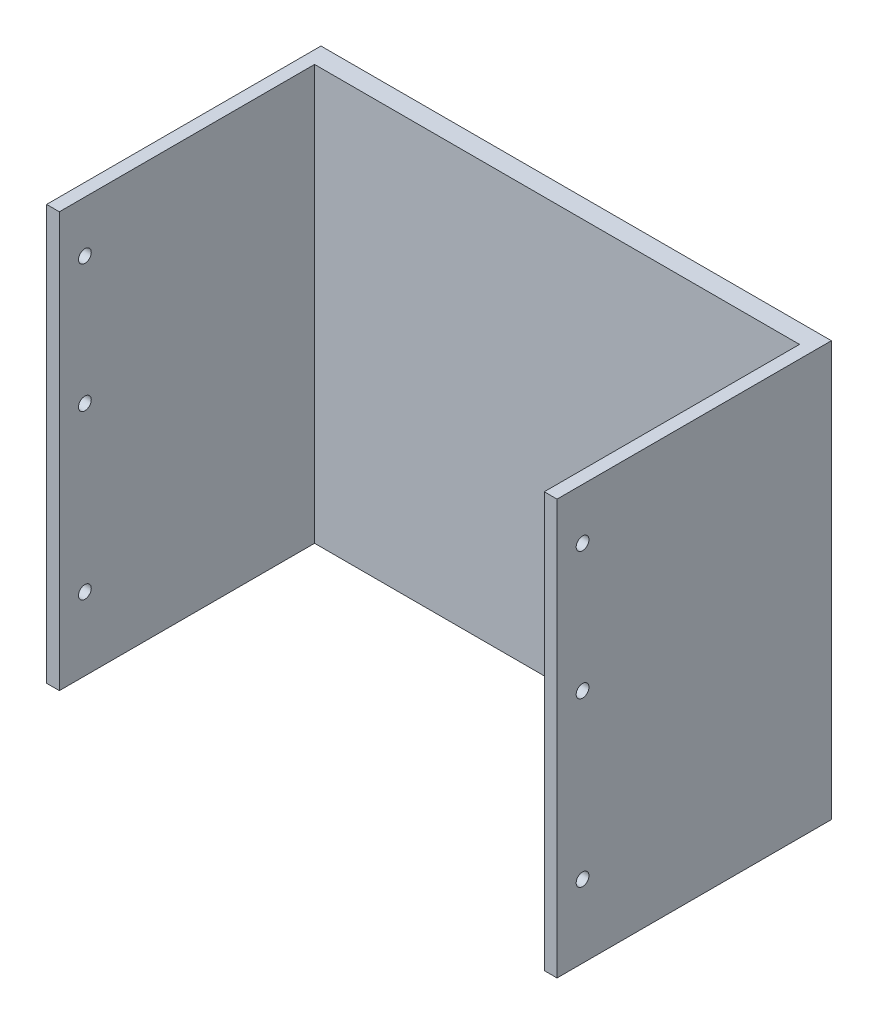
ISO-10303-21;
HEADER;
FILE_DESCRIPTION(('STEP AP214'),'2;1');
FILE_NAME('part.step','',(''),(''),'','','');
FILE_SCHEMA(('AUTOMOTIVE_DESIGN { 1 0 10303 214 1 1 1 1 }'));
ENDSEC;
DATA;
#1=APPLICATION_CONTEXT('core data for automotive mechanical design processes');
#2=APPLICATION_PROTOCOL_DEFINITION('international standard','automotive_design',2000,#1);
#3=PRODUCT_CONTEXT('',#1,'mechanical');
#4=PRODUCT('Part','Part','',(#3));
#5=PRODUCT_RELATED_PRODUCT_CATEGORY('part','',(#4));
#6=PRODUCT_DEFINITION_FORMATION('','',#4);
#7=PRODUCT_DEFINITION_CONTEXT('part definition',#1,'design');
#8=PRODUCT_DEFINITION('design','',#6,#7);
#9=PRODUCT_DEFINITION_SHAPE('','',#8);
#10=(LENGTH_UNIT() NAMED_UNIT(*) SI_UNIT(.MILLI.,.METRE.));
#11=(NAMED_UNIT(*) PLANE_ANGLE_UNIT() SI_UNIT($,.RADIAN.));
#12=(NAMED_UNIT(*) SI_UNIT($,.STERADIAN.) SOLID_ANGLE_UNIT());
#13=UNCERTAINTY_MEASURE_WITH_UNIT(LENGTH_MEASURE(1.E-05),#10,'distance_accuracy_value','');
#14=(GEOMETRIC_REPRESENTATION_CONTEXT(3) GLOBAL_UNCERTAINTY_ASSIGNED_CONTEXT((#13)) GLOBAL_UNIT_ASSIGNED_CONTEXT((#10,
#11,#12)) REPRESENTATION_CONTEXT('',''));
#15=CARTESIAN_POINT('',(0.,0.,0.));
#16=DIRECTION('',(0.,0.,1.));
#17=DIRECTION('',(1.,0.,0.));
#18=AXIS2_PLACEMENT_3D('',#15,#16,#17);
#19=CARTESIAN_POINT('',(40.,32.5,3.));
#20=DIRECTION('',(-1.,0.,0.));
#21=DIRECTION('',(0.,-1.,0.));
#22=AXIS2_PLACEMENT_3D('',#19,#20,#21);
#23=PLANE('',#22);
#24=CARTESIAN_POINT('',(40.,24.5,39.));
#25=DIRECTION('',(-1.,0.,0.));
#26=DIRECTION('',(0.,-1.,0.));
#27=AXIS2_PLACEMENT_3D('',#24,#25,#26);
#28=CIRCLE('',#27,0.999999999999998);
#29=CARTESIAN_POINT('',(40.,23.5,39.));
#30=VERTEX_POINT('',#29);
#31=EDGE_CURVE('E220',#30,#30,#28,.T.);
#32=ORIENTED_EDGE('',*,*,#31,.T.);
#33=EDGE_LOOP('',(#32));
#34=FACE_BOUND('',#33,.T.);
#35=CARTESIAN_POINT('',(40.,-21.0951452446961,39.));
#36=DIRECTION('',(-1.,0.,0.));
#37=DIRECTION('',(0.,-1.,0.));
#38=AXIS2_PLACEMENT_3D('',#35,#36,#37);
#39=CIRCLE('',#38,0.999999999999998);
#40=CARTESIAN_POINT('',(40.,-22.0951452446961,39.));
#41=VERTEX_POINT('',#40);
#42=EDGE_CURVE('E246',#41,#41,#39,.T.);
#43=ORIENTED_EDGE('',*,*,#42,.T.);
#44=EDGE_LOOP('',(#43));
#45=FACE_BOUND('',#44,.T.);
#46=CARTESIAN_POINT('',(40.,4.48535256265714,39.));
#47=DIRECTION('',(-1.,0.,0.));
#48=DIRECTION('',(0.,-1.,0.));
#49=AXIS2_PLACEMENT_3D('',#46,#47,#48);
#50=CIRCLE('',#49,0.999999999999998);
#51=CARTESIAN_POINT('',(40.,3.48535256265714,39.));
#52=VERTEX_POINT('',#51);
#53=EDGE_CURVE('E242',#52,#52,#50,.T.);
#54=ORIENTED_EDGE('',*,*,#53,.T.);
#55=EDGE_LOOP('',(#54));
#56=FACE_BOUND('',#55,.T.);
#57=DIRECTION('',(0.,1.,0.));
#58=VECTOR('',#57,1.);
#59=CARTESIAN_POINT('',(40.,32.5,0.));
#60=LINE('',#59,#58);
#61=CARTESIAN_POINT('',(40.,-32.5,0.));
#62=VERTEX_POINT('',#61);
#63=CARTESIAN_POINT('',(40.,32.5,0.));
#64=VERTEX_POINT('',#63);
#65=EDGE_CURVE('E156',#62,#64,#60,.T.);
#66=ORIENTED_EDGE('',*,*,#65,.T.);
#67=DIRECTION('',(0.,0.,-1.));
#68=VECTOR('',#67,1.);
#69=CARTESIAN_POINT('',(40.,32.5,3.));
#70=LINE('',#69,#68);
#71=CARTESIAN_POINT('',(40.,32.5,43.));
#72=VERTEX_POINT('',#71);
#73=EDGE_CURVE('E11',#72,#64,#70,.T.);
#74=ORIENTED_EDGE('',*,*,#73,.F.);
#75=DIRECTION('',(0.,1.,0.));
#76=VECTOR('',#75,1.);
#77=CARTESIAN_POINT('',(40.,32.5,43.));
#78=LINE('',#77,#76);
#79=CARTESIAN_POINT('',(40.,-32.5,43.));
#80=VERTEX_POINT('',#79);
#81=EDGE_CURVE('E169',#80,#72,#78,.T.);
#82=ORIENTED_EDGE('',*,*,#81,.F.);
#83=DIRECTION('',(0.,0.,-1.));
#84=VECTOR('',#83,1.);
#85=CARTESIAN_POINT('',(40.,-32.5,3.));
#86=LINE('',#85,#84);
#87=EDGE_CURVE('E122',#80,#62,#86,.T.);
#88=ORIENTED_EDGE('',*,*,#87,.T.);
#89=EDGE_LOOP('',(#66,#74,#82,#88));
#90=FACE_BOUND('',#89,.T.);
#91=ADVANCED_FACE('F45',(#34,#45,#56,#90),#23,.F.);
#92=CARTESIAN_POINT('',(-40.,32.5,3.));
#93=DIRECTION('',(0.,-1.,0.));
#94=DIRECTION('',(0.,0.,-1.));
#95=AXIS2_PLACEMENT_3D('',#92,#93,#94);
#96=PLANE('',#95);
#97=DIRECTION('',(-1.,0.,0.));
#98=VECTOR('',#97,1.);
#99=CARTESIAN_POINT('',(-40.,32.5,0.));
#100=LINE('',#99,#98);
#101=CARTESIAN_POINT('',(-40.,32.5,0.));
#102=VERTEX_POINT('',#101);
#103=EDGE_CURVE('E192',#64,#102,#100,.T.);
#104=ORIENTED_EDGE('',*,*,#103,.T.);
#105=DIRECTION('',(0.,0.,-1.));
#106=VECTOR('',#105,1.);
#107=CARTESIAN_POINT('',(-40.,32.5,3.));
#108=LINE('',#107,#106);
#109=CARTESIAN_POINT('',(-40.,32.5,43.));
#110=VERTEX_POINT('',#109);
#111=EDGE_CURVE('E54',#110,#102,#108,.T.);
#112=ORIENTED_EDGE('',*,*,#111,.F.);
#113=DIRECTION('',(-1.,0.,0.));
#114=VECTOR('',#113,1.);
#115=CARTESIAN_POINT('',(-40.,32.5,43.));
#116=LINE('',#115,#114);
#117=CARTESIAN_POINT('',(-38.,32.5,43.));
#118=VERTEX_POINT('',#117);
#119=EDGE_CURVE('E137',#118,#110,#116,.T.);
#120=ORIENTED_EDGE('',*,*,#119,.F.);
#121=DIRECTION('',(0.,0.,-1.));
#122=VECTOR('',#121,1.);
#123=CARTESIAN_POINT('',(-38.,32.5,43.));
#124=LINE('',#123,#122);
#125=CARTESIAN_POINT('',(-38.,32.5,3.));
#126=VERTEX_POINT('',#125);
#127=EDGE_CURVE('E149',#118,#126,#124,.T.);
#128=ORIENTED_EDGE('',*,*,#127,.T.);
#129=DIRECTION('',(-1.,0.,0.));
#130=VECTOR('',#129,1.);
#131=CARTESIAN_POINT('',(-40.,32.5,3.));
#132=LINE('',#131,#130);
#133=CARTESIAN_POINT('',(38.,32.5,3.));
#134=VERTEX_POINT('',#133);
#135=EDGE_CURVE('E182',#134,#126,#132,.T.);
#136=ORIENTED_EDGE('',*,*,#135,.F.);
#137=DIRECTION('',(0.,0.,-1.));
#138=VECTOR('',#137,1.);
#139=CARTESIAN_POINT('',(38.,32.5,43.));
#140=LINE('',#139,#138);
#141=CARTESIAN_POINT('',(38.,32.5,43.));
#142=VERTEX_POINT('',#141);
#143=EDGE_CURVE('E157',#142,#134,#140,.T.);
#144=ORIENTED_EDGE('',*,*,#143,.F.);
#145=DIRECTION('',(-1.,0.,0.));
#146=VECTOR('',#145,1.);
#147=CARTESIAN_POINT('',(40.,32.5,43.));
#148=LINE('',#147,#146);
#149=EDGE_CURVE('E176',#72,#142,#148,.T.);
#150=ORIENTED_EDGE('',*,*,#149,.F.);
#151=ORIENTED_EDGE('',*,*,#73,.T.);
#152=EDGE_LOOP('',(#104,#112,#120,#128,#136,#144,#150,#151));
#153=FACE_BOUND('',#152,.T.);
#154=ADVANCED_FACE('F267',(#153),#96,.F.);
#155=CARTESIAN_POINT('',(-40.,32.5,3.));
#156=DIRECTION('',(1.,0.,0.));
#157=DIRECTION('',(0.,1.,0.));
#158=AXIS2_PLACEMENT_3D('',#155,#156,#157);
#159=PLANE('',#158);
#160=CARTESIAN_POINT('',(-40.,24.5,39.));
#161=DIRECTION('',(-1.,0.,0.));
#162=DIRECTION('',(0.,-1.,0.));
#163=AXIS2_PLACEMENT_3D('',#160,#161,#162);
#164=CIRCLE('',#163,0.999999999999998);
#165=CARTESIAN_POINT('',(-40.,23.5,39.));
#166=VERTEX_POINT('',#165);
#167=EDGE_CURVE('E209',#166,#166,#164,.T.);
#168=ORIENTED_EDGE('',*,*,#167,.F.);
#169=EDGE_LOOP('',(#168));
#170=FACE_BOUND('',#169,.T.);
#171=CARTESIAN_POINT('',(-40.,-21.0951452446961,39.));
#172=DIRECTION('',(-1.,0.,0.));
#173=DIRECTION('',(0.,-1.,0.));
#174=AXIS2_PLACEMENT_3D('',#171,#172,#173);
#175=CIRCLE('',#174,0.999999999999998);
#176=CARTESIAN_POINT('',(-40.,-22.0951452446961,39.));
#177=VERTEX_POINT('',#176);
#178=EDGE_CURVE('E231',#177,#177,#175,.T.);
#179=ORIENTED_EDGE('',*,*,#178,.F.);
#180=EDGE_LOOP('',(#179));
#181=FACE_BOUND('',#180,.T.);
#182=CARTESIAN_POINT('',(-40.,4.48535256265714,39.));
#183=DIRECTION('',(-1.,0.,0.));
#184=DIRECTION('',(0.,-1.,0.));
#185=AXIS2_PLACEMENT_3D('',#182,#183,#184);
#186=CIRCLE('',#185,0.999999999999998);
#187=CARTESIAN_POINT('',(-40.,3.48535256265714,39.));
#188=VERTEX_POINT('',#187);
#189=EDGE_CURVE('E143',#188,#188,#186,.T.);
#190=ORIENTED_EDGE('',*,*,#189,.F.);
#191=EDGE_LOOP('',(#190));
#192=FACE_BOUND('',#191,.T.);
#193=DIRECTION('',(0.,-1.,0.));
#194=VECTOR('',#193,1.);
#195=CARTESIAN_POINT('',(-40.,32.5,0.));
#196=LINE('',#195,#194);
#197=CARTESIAN_POINT('',(-40.,-32.5,0.));
#198=VERTEX_POINT('',#197);
#199=EDGE_CURVE('E118',#102,#198,#196,.T.);
#200=ORIENTED_EDGE('',*,*,#199,.T.);
#201=DIRECTION('',(0.,0.,-1.));
#202=VECTOR('',#201,1.);
#203=CARTESIAN_POINT('',(-40.,-32.5,3.));
#204=LINE('',#203,#202);
#205=CARTESIAN_POINT('',(-40.,-32.5,43.));
#206=VERTEX_POINT('',#205);
#207=EDGE_CURVE('E111',#206,#198,#204,.T.);
#208=ORIENTED_EDGE('',*,*,#207,.F.);
#209=DIRECTION('',(0.,-1.,0.));
#210=VECTOR('',#209,1.);
#211=CARTESIAN_POINT('',(-40.,32.5,43.));
#212=LINE('',#211,#210);
#213=EDGE_CURVE('E116',#110,#206,#212,.T.);
#214=ORIENTED_EDGE('',*,*,#213,.F.);
#215=ORIENTED_EDGE('',*,*,#111,.T.);
#216=EDGE_LOOP('',(#200,#208,#214,#215));
#217=FACE_BOUND('',#216,.T.);
#218=ADVANCED_FACE('F113',(#170,#181,#192,#217),#159,.F.);
#219=CARTESIAN_POINT('',(-40.,-32.5,3.));
#220=DIRECTION('',(0.,1.,0.));
#221=DIRECTION('',(0.,0.,1.));
#222=AXIS2_PLACEMENT_3D('',#219,#220,#221);
#223=PLANE('',#222);
#224=DIRECTION('',(1.,0.,0.));
#225=VECTOR('',#224,1.);
#226=CARTESIAN_POINT('',(-40.,-32.5,0.));
#227=LINE('',#226,#225);
#228=EDGE_CURVE('E186',#198,#62,#227,.T.);
#229=ORIENTED_EDGE('',*,*,#228,.T.);
#230=ORIENTED_EDGE('',*,*,#87,.F.);
#231=DIRECTION('',(1.,0.,0.));
#232=VECTOR('',#231,1.);
#233=CARTESIAN_POINT('',(40.,-32.5,43.));
#234=LINE('',#233,#232);
#235=CARTESIAN_POINT('',(38.,-32.5,43.));
#236=VERTEX_POINT('',#235);
#237=EDGE_CURVE('E166',#236,#80,#234,.T.);
#238=ORIENTED_EDGE('',*,*,#237,.F.);
#239=DIRECTION('',(0.,0.,-1.));
#240=VECTOR('',#239,1.);
#241=CARTESIAN_POINT('',(38.,-32.5,43.));
#242=LINE('',#241,#240);
#243=CARTESIAN_POINT('',(38.,-32.5,3.));
#244=VERTEX_POINT('',#243);
#245=EDGE_CURVE('E161',#236,#244,#242,.T.);
#246=ORIENTED_EDGE('',*,*,#245,.T.);
#247=DIRECTION('',(1.,0.,0.));
#248=VECTOR('',#247,1.);
#249=CARTESIAN_POINT('',(-40.,-32.5,3.));
#250=LINE('',#249,#248);
#251=CARTESIAN_POINT('',(-38.,-32.5,3.));
#252=VERTEX_POINT('',#251);
#253=EDGE_CURVE('E185',#252,#244,#250,.T.);
#254=ORIENTED_EDGE('',*,*,#253,.F.);
#255=DIRECTION('',(0.,0.,-1.));
#256=VECTOR('',#255,1.);
#257=CARTESIAN_POINT('',(-38.,-32.5,43.));
#258=LINE('',#257,#256);
#259=CARTESIAN_POINT('',(-38.,-32.5,43.));
#260=VERTEX_POINT('',#259);
#261=EDGE_CURVE('E128',#260,#252,#258,.T.);
#262=ORIENTED_EDGE('',*,*,#261,.F.);
#263=DIRECTION('',(1.,0.,0.));
#264=VECTOR('',#263,1.);
#265=CARTESIAN_POINT('',(-40.,-32.5,43.));
#266=LINE('',#265,#264);
#267=EDGE_CURVE('E125',#206,#260,#266,.T.);
#268=ORIENTED_EDGE('',*,*,#267,.F.);
#269=ORIENTED_EDGE('',*,*,#207,.T.);
#270=EDGE_LOOP('',(#229,#230,#238,#246,#254,#262,#268,#269));
#271=FACE_BOUND('',#270,.T.);
#272=ADVANCED_FACE('F126',(#271),#223,.F.);
#273=CARTESIAN_POINT('',(0.,0.,3.));
#274=DIRECTION('',(0.,0.,1.));
#275=DIRECTION('',(1.,0.,0.));
#276=AXIS2_PLACEMENT_3D('',#273,#274,#275);
#277=PLANE('',#276);
#278=DIRECTION('',(0.,1.,0.));
#279=VECTOR('',#278,1.);
#280=CARTESIAN_POINT('',(-38.,32.5,3.));
#281=LINE('',#280,#279);
#282=EDGE_CURVE('E62',#252,#126,#281,.T.);
#283=ORIENTED_EDGE('',*,*,#282,.F.);
#284=ORIENTED_EDGE('',*,*,#253,.T.);
#285=DIRECTION('',(0.,-1.,0.));
#286=VECTOR('',#285,1.);
#287=CARTESIAN_POINT('',(38.,32.5,3.));
#288=LINE('',#287,#286);
#289=EDGE_CURVE('E67',#134,#244,#288,.T.);
#290=ORIENTED_EDGE('',*,*,#289,.F.);
#291=ORIENTED_EDGE('',*,*,#135,.T.);
#292=EDGE_LOOP('',(#283,#284,#290,#291));
#293=FACE_BOUND('',#292,.T.);
#294=ADVANCED_FACE('F283',(#293),#277,.T.);
#295=CARTESIAN_POINT('',(0.,0.,0.));
#296=DIRECTION('',(0.,0.,1.));
#297=DIRECTION('',(1.,0.,0.));
#298=AXIS2_PLACEMENT_3D('',#295,#296,#297);
#299=PLANE('',#298);
#300=ORIENTED_EDGE('',*,*,#65,.F.);
#301=ORIENTED_EDGE('',*,*,#228,.F.);
#302=ORIENTED_EDGE('',*,*,#199,.F.);
#303=ORIENTED_EDGE('',*,*,#103,.F.);
#304=EDGE_LOOP('',(#300,#301,#302,#303));
#305=FACE_BOUND('',#304,.T.);
#306=ADVANCED_FACE('F284',(#305),#299,.F.);
#307=CARTESIAN_POINT('',(38.,32.5,43.));
#308=DIRECTION('',(1.,0.,0.));
#309=DIRECTION('',(0.,1.,0.));
#310=AXIS2_PLACEMENT_3D('',#307,#308,#309);
#311=PLANE('',#310);
#312=CARTESIAN_POINT('',(38.,24.5,39.));
#313=DIRECTION('',(1.,0.,0.));
#314=DIRECTION('',(0.,1.,0.));
#315=AXIS2_PLACEMENT_3D('',#312,#313,#314);
#316=CIRCLE('',#315,0.999999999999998);
#317=CARTESIAN_POINT('',(38.,25.5,39.));
#318=VERTEX_POINT('',#317);
#319=EDGE_CURVE('E48',#318,#318,#316,.F.);
#320=ORIENTED_EDGE('',*,*,#319,.F.);
#321=EDGE_LOOP('',(#320));
#322=FACE_BOUND('',#321,.T.);
#323=CARTESIAN_POINT('',(38.,-21.0951452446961,39.));
#324=DIRECTION('',(1.,0.,0.));
#325=DIRECTION('',(0.,1.,0.));
#326=AXIS2_PLACEMENT_3D('',#323,#324,#325);
#327=CIRCLE('',#326,0.999999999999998);
#328=CARTESIAN_POINT('',(38.,-20.0951452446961,39.));
#329=VERTEX_POINT('',#328);
#330=EDGE_CURVE('E219',#329,#329,#327,.F.);
#331=ORIENTED_EDGE('',*,*,#330,.F.);
#332=EDGE_LOOP('',(#331));
#333=FACE_BOUND('',#332,.T.);
#334=CARTESIAN_POINT('',(38.,4.48535256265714,39.));
#335=DIRECTION('',(1.,0.,0.));
#336=DIRECTION('',(0.,1.,0.));
#337=AXIS2_PLACEMENT_3D('',#334,#335,#336);
#338=CIRCLE('',#337,0.999999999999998);
#339=CARTESIAN_POINT('',(38.,5.48535256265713,39.));
#340=VERTEX_POINT('',#339);
#341=EDGE_CURVE('E216',#340,#340,#338,.F.);
#342=ORIENTED_EDGE('',*,*,#341,.F.);
#343=EDGE_LOOP('',(#342));
#344=FACE_BOUND('',#343,.T.);
#345=ORIENTED_EDGE('',*,*,#289,.T.);
#346=ORIENTED_EDGE('',*,*,#245,.F.);
#347=DIRECTION('',(0.,-1.,0.));
#348=VECTOR('',#347,1.);
#349=CARTESIAN_POINT('',(38.,32.5,43.));
#350=LINE('',#349,#348);
#351=EDGE_CURVE('E173',#142,#236,#350,.T.);
#352=ORIENTED_EDGE('',*,*,#351,.F.);
#353=ORIENTED_EDGE('',*,*,#143,.T.);
#354=EDGE_LOOP('',(#345,#346,#352,#353));
#355=FACE_BOUND('',#354,.T.);
#356=ADVANCED_FACE('F286',(#322,#333,#344,#355),#311,.F.);
#357=CARTESIAN_POINT('',(0.,0.,43.));
#358=DIRECTION('',(0.,0.,-1.));
#359=DIRECTION('',(-1.,0.,0.));
#360=AXIS2_PLACEMENT_3D('',#357,#358,#359);
#361=PLANE('',#360);
#362=ORIENTED_EDGE('',*,*,#81,.T.);
#363=ORIENTED_EDGE('',*,*,#149,.T.);
#364=ORIENTED_EDGE('',*,*,#351,.T.);
#365=ORIENTED_EDGE('',*,*,#237,.T.);
#366=EDGE_LOOP('',(#362,#363,#364,#365));
#367=FACE_BOUND('',#366,.T.);
#368=ADVANCED_FACE('F290',(#367),#361,.F.);
#369=CARTESIAN_POINT('',(-38.,32.5,43.));
#370=DIRECTION('',(-1.,0.,0.));
#371=DIRECTION('',(0.,-1.,0.));
#372=AXIS2_PLACEMENT_3D('',#369,#370,#371);
#373=PLANE('',#372);
#374=CARTESIAN_POINT('',(-38.,24.5,39.));
#375=DIRECTION('',(-1.,0.,0.));
#376=DIRECTION('',(0.,-1.,0.));
#377=AXIS2_PLACEMENT_3D('',#374,#375,#376);
#378=CIRCLE('',#377,0.999999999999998);
#379=CARTESIAN_POINT('',(-38.,23.5,39.));
#380=VERTEX_POINT('',#379);
#381=EDGE_CURVE('E162',#380,#380,#378,.T.);
#382=ORIENTED_EDGE('',*,*,#381,.T.);
#383=EDGE_LOOP('',(#382));
#384=FACE_BOUND('',#383,.T.);
#385=CARTESIAN_POINT('',(-38.,-21.0951452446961,39.));
#386=DIRECTION('',(-1.,0.,0.));
#387=DIRECTION('',(0.,-1.,0.));
#388=AXIS2_PLACEMENT_3D('',#385,#386,#387);
#389=CIRCLE('',#388,0.999999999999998);
#390=CARTESIAN_POINT('',(-38.,-22.0951452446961,39.));
#391=VERTEX_POINT('',#390);
#392=EDGE_CURVE('E208',#391,#391,#389,.T.);
#393=ORIENTED_EDGE('',*,*,#392,.T.);
#394=EDGE_LOOP('',(#393));
#395=FACE_BOUND('',#394,.T.);
#396=CARTESIAN_POINT('',(-38.,4.48535256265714,39.));
#397=DIRECTION('',(-1.,0.,0.));
#398=DIRECTION('',(0.,-1.,0.));
#399=AXIS2_PLACEMENT_3D('',#396,#397,#398);
#400=CIRCLE('',#399,0.999999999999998);
#401=CARTESIAN_POINT('',(-38.,3.48535256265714,39.));
#402=VERTEX_POINT('',#401);
#403=EDGE_CURVE('E204',#402,#402,#400,.T.);
#404=ORIENTED_EDGE('',*,*,#403,.T.);
#405=EDGE_LOOP('',(#404));
#406=FACE_BOUND('',#405,.T.);
#407=ORIENTED_EDGE('',*,*,#282,.T.);
#408=ORIENTED_EDGE('',*,*,#127,.F.);
#409=DIRECTION('',(0.,1.,0.));
#410=VECTOR('',#409,1.);
#411=CARTESIAN_POINT('',(-38.,32.5,43.));
#412=LINE('',#411,#410);
#413=EDGE_CURVE('E132',#260,#118,#412,.T.);
#414=ORIENTED_EDGE('',*,*,#413,.F.);
#415=ORIENTED_EDGE('',*,*,#261,.T.);
#416=EDGE_LOOP('',(#407,#408,#414,#415));
#417=FACE_BOUND('',#416,.T.);
#418=ADVANCED_FACE('F293',(#384,#395,#406,#417),#373,.F.);
#419=CARTESIAN_POINT('',(0.,0.,43.));
#420=DIRECTION('',(0.,0.,1.));
#421=DIRECTION('',(1.,0.,0.));
#422=AXIS2_PLACEMENT_3D('',#419,#420,#421);
#423=PLANE('',#422);
#424=ORIENTED_EDGE('',*,*,#213,.T.);
#425=ORIENTED_EDGE('',*,*,#267,.T.);
#426=ORIENTED_EDGE('',*,*,#413,.T.);
#427=ORIENTED_EDGE('',*,*,#119,.T.);
#428=EDGE_LOOP('',(#424,#425,#426,#427));
#429=FACE_BOUND('',#428,.T.);
#430=ADVANCED_FACE('F135',(#429),#423,.T.);
#431=CARTESIAN_POINT('',(-30.,4.48535256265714,39.));
#432=DIRECTION('',(-1.,0.,0.));
#433=DIRECTION('',(0.,-1.,0.));
#434=AXIS2_PLACEMENT_3D('',#431,#432,#433);
#435=CYLINDRICAL_SURFACE('',#434,0.999999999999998);
#436=ORIENTED_EDGE('',*,*,#189,.T.);
#437=EDGE_LOOP('',(#436));
#438=FACE_BOUND('',#437,.T.);
#439=ORIENTED_EDGE('',*,*,#403,.F.);
#440=EDGE_LOOP('',(#439));
#441=FACE_BOUND('',#440,.T.);
#442=ADVANCED_FACE('F302',(#438,#441),#435,.F.);
#443=CARTESIAN_POINT('',(-30.,-21.0951452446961,39.));
#444=DIRECTION('',(-1.,0.,0.));
#445=DIRECTION('',(0.,-1.,0.));
#446=AXIS2_PLACEMENT_3D('',#443,#444,#445);
#447=CYLINDRICAL_SURFACE('',#446,0.999999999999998);
#448=ORIENTED_EDGE('',*,*,#178,.T.);
#449=EDGE_LOOP('',(#448));
#450=FACE_BOUND('',#449,.T.);
#451=ORIENTED_EDGE('',*,*,#392,.F.);
#452=EDGE_LOOP('',(#451));
#453=FACE_BOUND('',#452,.T.);
#454=ADVANCED_FACE('F305',(#450,#453),#447,.F.);
#455=CARTESIAN_POINT('',(-30.,24.5,39.));
#456=DIRECTION('',(-1.,0.,0.));
#457=DIRECTION('',(0.,-1.,0.));
#458=AXIS2_PLACEMENT_3D('',#455,#456,#457);
#459=CYLINDRICAL_SURFACE('',#458,0.999999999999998);
#460=ORIENTED_EDGE('',*,*,#167,.T.);
#461=EDGE_LOOP('',(#460));
#462=FACE_BOUND('',#461,.T.);
#463=ORIENTED_EDGE('',*,*,#381,.F.);
#464=EDGE_LOOP('',(#463));
#465=FACE_BOUND('',#464,.T.);
#466=ADVANCED_FACE('F308',(#462,#465),#459,.F.);
#467=CARTESIAN_POINT('',(30.,4.48535256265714,39.));
#468=DIRECTION('',(1.,0.,0.));
#469=DIRECTION('',(0.,1.,0.));
#470=AXIS2_PLACEMENT_3D('',#467,#468,#469);
#471=CYLINDRICAL_SURFACE('',#470,0.999999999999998);
#472=ORIENTED_EDGE('',*,*,#53,.F.);
#473=EDGE_LOOP('',(#472));
#474=FACE_BOUND('',#473,.T.);
#475=ORIENTED_EDGE('',*,*,#341,.T.);
#476=EDGE_LOOP('',(#475));
#477=FACE_BOUND('',#476,.T.);
#478=ADVANCED_FACE('F263',(#474,#477),#471,.F.);
#479=CARTESIAN_POINT('',(30.,-21.0951452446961,39.));
#480=DIRECTION('',(1.,0.,0.));
#481=DIRECTION('',(0.,1.,0.));
#482=AXIS2_PLACEMENT_3D('',#479,#480,#481);
#483=CYLINDRICAL_SURFACE('',#482,0.999999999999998);
#484=ORIENTED_EDGE('',*,*,#42,.F.);
#485=EDGE_LOOP('',(#484));
#486=FACE_BOUND('',#485,.T.);
#487=ORIENTED_EDGE('',*,*,#330,.T.);
#488=EDGE_LOOP('',(#487));
#489=FACE_BOUND('',#488,.T.);
#490=ADVANCED_FACE('F258',(#486,#489),#483,.F.);
#491=CARTESIAN_POINT('',(30.,24.5,39.));
#492=DIRECTION('',(1.,0.,0.));
#493=DIRECTION('',(0.,1.,0.));
#494=AXIS2_PLACEMENT_3D('',#491,#492,#493);
#495=CYLINDRICAL_SURFACE('',#494,0.999999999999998);
#496=ORIENTED_EDGE('',*,*,#31,.F.);
#497=EDGE_LOOP('',(#496));
#498=FACE_BOUND('',#497,.T.);
#499=ORIENTED_EDGE('',*,*,#319,.T.);
#500=EDGE_LOOP('',(#499));
#501=FACE_BOUND('',#500,.T.);
#502=ADVANCED_FACE('F256',(#498,#501),#495,.F.);
#503=CLOSED_SHELL('',(#91,#154,#218,#272,#294,#306,#356,#368,#418,#430,#442,#454,#466,#478,#490,#502));
#504=MANIFOLD_SOLID_BREP('B2',#503);
#505=ADVANCED_BREP_SHAPE_REPRESENTATION('',(#18,#504),#14);
#506=SHAPE_DEFINITION_REPRESENTATION(#9,#505);
ENDSEC;
END-ISO-10303-21;
